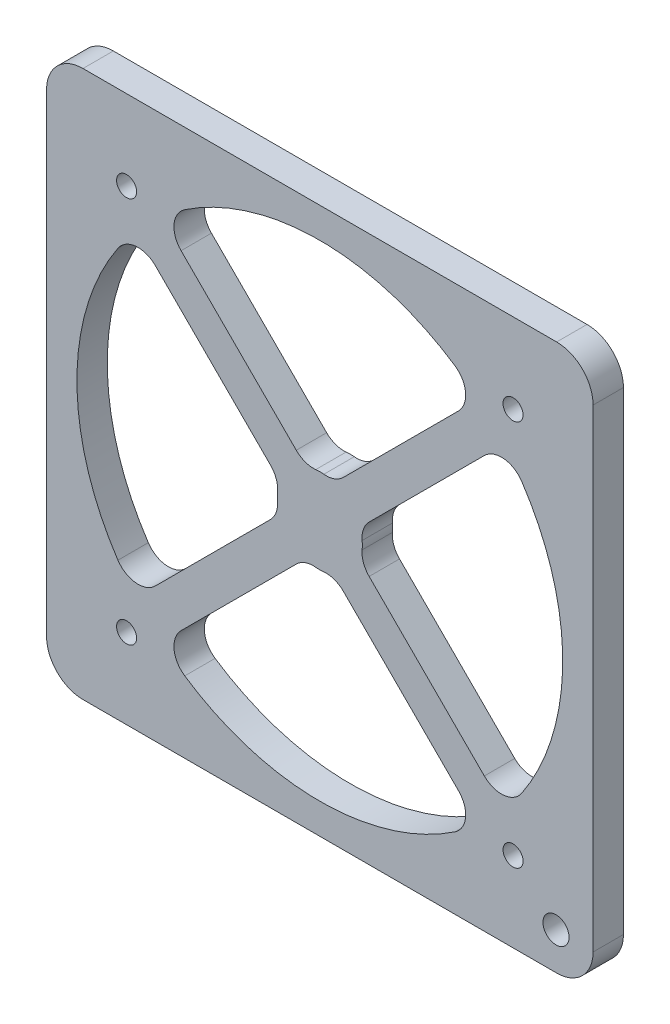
from build123d import *

# Parameters (mm, degrees)
SKETCH1_W             = 90
SKETCH1_H             = 90
BOSS_EXTRUDE1_DEPTH   = 5
SKETCH1_4_R           = 5
CUT_EXTRUDE1_DEPTH    = 3
F_3_0MM_DOWEL_HOLE1_D = 3.3
FILLET1_R             = 4
FILLET2_R             = 4
F_4_0MM_DOWEL_HOLE1_D = 4.3
FILLET3_R             = 6
MOVE_FACE1_BY         = 0.15


with BuildPart() as part:
    # Sketch1 → Boss-Extrude1 (new body)
    with BuildSketch(Plane.XY):
        Rectangle(SKETCH1_W, SKETCH1_H)
        with BuildLine():
            ThreePointArc((26.083289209, -30.325929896), (0, -40), (-26.083289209, -30.325929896))
            Line((-26.083289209, -30.325929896), (-2.350815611, -6.593456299))
            ThreePointArc((-2.350815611, -6.593456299), (0, -7), (2.350815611, -6.593456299))
            Line((2.350815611, -6.593456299), (26.083289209, -30.325929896))
        make_face(mode=Mode.SUBTRACT)
        with BuildLine():
            Line((-30.325929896, 26.083289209), (-6.593456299, 2.350815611))
            ThreePointArc((-6.593456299, 2.350815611), (-7, 0), (-6.593456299, -2.350815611))
            Line((-6.593456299, -2.350815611), (-30.325929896, -26.083289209))
            ThreePointArc((-30.325929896, -26.083289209), (-40, 0), (-30.325929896, 26.083289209))
        make_face(mode=Mode.SUBTRACT)
        with BuildLine():
            ThreePointArc((-26.083289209, 30.325929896), (0, 40), (26.083289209, 30.325929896))
            Line((26.083289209, 30.325929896), (2.350815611, 6.593456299))
            ThreePointArc((2.350815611, 6.593456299), (0, 7), (-2.350815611, 6.593456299))
            Line((-2.350815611, 6.593456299), (-26.083289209, 30.325929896))
        make_face(mode=Mode.SUBTRACT)
        with BuildLine():
            ThreePointArc((30.325929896, 26.083289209), (40, 0), (30.325929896, -26.083289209))
            Line((30.325929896, -26.083289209), (6.593456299, -2.350815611))
            ThreePointArc((6.593456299, -2.350815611), (7, 0), (6.593456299, 2.350815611))
            Line((6.593456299, 2.350815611), (30.325929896, 26.083289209))
        make_face(mode=Mode.SUBTRACT)
    extrude(amount=BOSS_EXTRUDE1_DEPTH)

    # Sketch1_4 → Cut-Extrude1 (cut)
    with BuildSketch(Plane.XY):
        Circle(SKETCH1_4_R)
    extrude(amount=CUT_EXTRUDE1_DEPTH, mode=Mode.SUBTRACT)

    # 3.0mm Dowel Hole1 (through all)
    with Locations(Plane(origin=(0, 0, 0), x_dir=(-1, 0, 0), z_dir=(0, 0, -1))):
        with Locations((-31.819805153, 31.819805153), (31.819805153, 31.819805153), (31.819805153, -31.819805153), (-31.819805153, -31.819805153)):
            Hole(F_3_0MM_DOWEL_HOLE1_D / 2)

    # Fillet1
    fillet1_edges = [part.edges().sort_by_distance(p)[0] for p in [
        (-30.325929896, 26.083289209, 2.5),
        (-30.325929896, -26.083289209, 2.5),
        (26.083289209, 30.325929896, 2.5),
        (-26.083289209, 30.325929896, 2.5),
        (30.325929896, -26.083289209, 2.5),
        (30.325929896, 26.083289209, 2.5),
        (-26.083289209, -30.325929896, 2.5),
        (26.083289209, -30.325929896, 2.5),
    ]]
    fillet(fillet1_edges, radius=FILLET1_R)

    # Fillet2
    fillet2_edges = [part.edges().sort_by_distance(p)[0] for p in [
        (-6.593456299, -2.350815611, 2.5),
        (-6.593456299, 2.350815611, 2.5),
        (-2.350815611, 6.593456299, 2.5),
        (2.350815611, 6.593456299, 2.5),
        (6.593456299, 2.350815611, 2.5),
        (6.593456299, -2.350815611, 2.5),
        (2.350815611, -6.593456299, 2.5),
        (-2.350815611, -6.593456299, 2.5),
    ]]
    fillet(fillet2_edges, radius=FILLET2_R)

    # 4.0mm Dowel Hole1 (through all)
    with Locations(Plane(origin=(0, 0, 0), x_dir=(-1, 0, 0), z_dir=(0, 0, -1))):
        with Locations((-38.890872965, -38.890872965)):
            Hole(F_4_0MM_DOWEL_HOLE1_D / 2)

    # Fillet3
    fillet3_edges = [part.edges().sort_by_distance(p)[0] for p in [
        (-45, -45, 2.5),
        (-45, 45, 2.5),
        (45, 45, 2.5),
        (45, -45, 2.5),
    ]]
    fillet(fillet3_edges, radius=FILLET3_R)

    # Move Face1: a curved face moved inward by 0.15
    add(Solid.thicken(part.faces().sort_by_distance((-5, 0, 1.5))[0], -MOVE_FACE1_BY), mode=Mode.SUBTRACT)


solid = part.part
